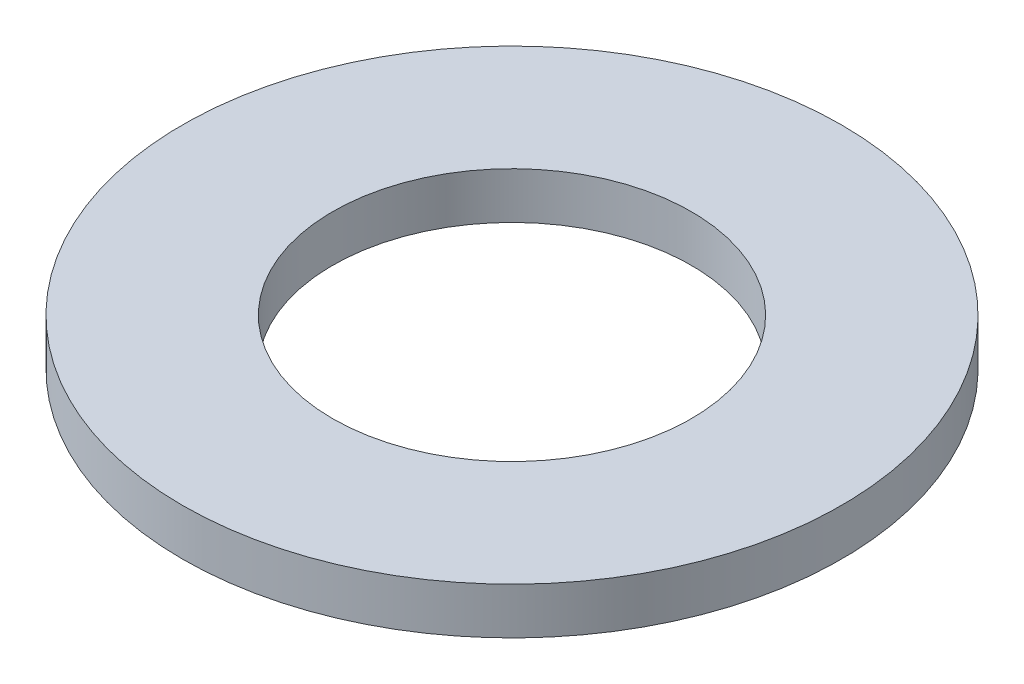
from build123d import *

# Parameters (mm, degrees)
SKETCH1_R           = 13.4874
BOSS_EXTRUDE1_DEPTH = 1.905
SKETCH5_R           = 7.3406
CUT_EXTRUDE1_DEPTH  = 20.168957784


with BuildPart() as part:
    # Sketch1 → Boss-Extrude1 (new body)
    with BuildSketch(Plane(origin=(0, 0, 0), x_dir=(1, 0, 0), z_dir=(0, 1, 0))):
        with Locations(Location((0, 0, 0), (0, 0, 90))):
            Circle(SKETCH1_R)
    extrude(amount=BOSS_EXTRUDE1_DEPTH)

    # Sketch5 → Cut-Extrude1 (cut, through all)
    with BuildSketch(Plane(origin=(0, 1.905, 0), x_dir=(-1, 0, 0), z_dir=(0, 1, 0))):
        with Locations(Location((0, 0, 0), (0, 0, 90))):
            Circle(SKETCH5_R)
    extrude(amount=-CUT_EXTRUDE1_DEPTH, mode=Mode.SUBTRACT)


solid = part.part
